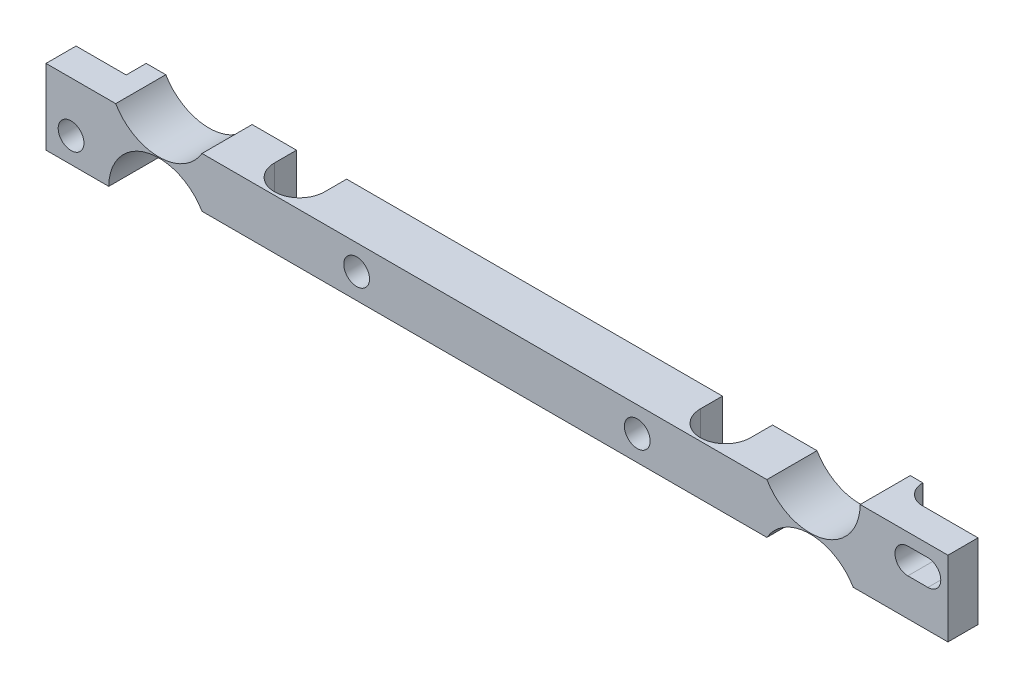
ISO-10303-21;
HEADER;
FILE_DESCRIPTION(('STEP AP214'),'2;1');
FILE_NAME('part.step','',(''),(''),'','','');
FILE_SCHEMA(('AUTOMOTIVE_DESIGN { 1 0 10303 214 1 1 1 1 }'));
ENDSEC;
DATA;
#1=APPLICATION_CONTEXT('core data for automotive mechanical design processes');
#2=APPLICATION_PROTOCOL_DEFINITION('international standard','automotive_design',2000,#1);
#3=PRODUCT_CONTEXT('',#1,'mechanical');
#4=PRODUCT('Part','Part','',(#3));
#5=PRODUCT_RELATED_PRODUCT_CATEGORY('part','',(#4));
#6=PRODUCT_DEFINITION_FORMATION('','',#4);
#7=PRODUCT_DEFINITION_CONTEXT('part definition',#1,'design');
#8=PRODUCT_DEFINITION('design','',#6,#7);
#9=PRODUCT_DEFINITION_SHAPE('','',#8);
#10=(LENGTH_UNIT() NAMED_UNIT(*) SI_UNIT(.MILLI.,.METRE.));
#11=(NAMED_UNIT(*) PLANE_ANGLE_UNIT() SI_UNIT($,.RADIAN.));
#12=(NAMED_UNIT(*) SI_UNIT($,.STERADIAN.) SOLID_ANGLE_UNIT());
#13=UNCERTAINTY_MEASURE_WITH_UNIT(LENGTH_MEASURE(1.E-05),#10,'distance_accuracy_value','');
#14=(GEOMETRIC_REPRESENTATION_CONTEXT(3) GLOBAL_UNCERTAINTY_ASSIGNED_CONTEXT((#13)) GLOBAL_UNIT_ASSIGNED_CONTEXT((#10,
#11,#12)) REPRESENTATION_CONTEXT('',''));
#15=CARTESIAN_POINT('',(0.,0.,0.));
#16=DIRECTION('',(0.,0.,1.));
#17=DIRECTION('',(1.,0.,0.));
#18=AXIS2_PLACEMENT_3D('',#15,#16,#17);
#19=CARTESIAN_POINT('',(-32.4430669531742,3.17499999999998,6.35));
#20=DIRECTION('',(0.,1.,0.));
#21=DIRECTION('',(-1.,0.,0.));
#22=AXIS2_PLACEMENT_3D('',#19,#20,#21);
#23=PLANE('',#22);
#24=DIRECTION('',(0.,0.,-1.));
#25=VECTOR('',#24,1.);
#26=CARTESIAN_POINT('',(79.375,3.175,6.35));
#27=LINE('',#26,#25);
#28=CARTESIAN_POINT('',(79.375,3.175,2.794));
#29=VERTEX_POINT('',#28);
#30=CARTESIAN_POINT('',(79.375,3.17499999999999,0.));
#31=VERTEX_POINT('',#30);
#32=EDGE_CURVE('E252',#29,#31,#27,.T.);
#33=ORIENTED_EDGE('',*,*,#32,.F.);
#34=CARTESIAN_POINT('',(82.55,3.175,2.794));
#35=DIRECTION('',(0.,1.,0.));
#36=DIRECTION('',(-1.,0.,0.));
#37=AXIS2_PLACEMENT_3D('',#34,#35,#36);
#38=CIRCLE('',#37,3.175);
#39=CARTESIAN_POINT('',(85.725,3.175,2.794));
#40=VERTEX_POINT('',#39);
#41=EDGE_CURVE('E229',#29,#40,#38,.T.);
#42=ORIENTED_EDGE('',*,*,#41,.T.);
#43=DIRECTION('',(0.,0.,-1.));
#44=VECTOR('',#43,1.);
#45=CARTESIAN_POINT('',(85.725,3.175,6.35));
#46=LINE('',#45,#44);
#47=CARTESIAN_POINT('',(85.725,3.17499999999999,0.));
#48=VERTEX_POINT('',#47);
#49=EDGE_CURVE('E248',#40,#48,#46,.T.);
#50=ORIENTED_EDGE('',*,*,#49,.T.);
#51=DIRECTION('',(1.,0.,0.));
#52=VECTOR('',#51,1.);
#53=CARTESIAN_POINT('',(-32.4430669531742,3.17499999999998,0.));
#54=LINE('',#53,#52);
#55=CARTESIAN_POINT('',(91.3551826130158,3.175,0.));
#56=VERTEX_POINT('',#55);
#57=EDGE_CURVE('E371',#48,#56,#54,.T.);
#58=ORIENTED_EDGE('',*,*,#57,.T.);
#59=DIRECTION('',(0.,0.,-1.));
#60=VECTOR('',#59,1.);
#61=CARTESIAN_POINT('',(91.3551826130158,3.175,6.35));
#62=LINE('',#61,#60);
#63=CARTESIAN_POINT('',(91.3551826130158,3.175,6.35));
#64=VERTEX_POINT('',#63);
#65=EDGE_CURVE('E432',#64,#56,#62,.T.);
#66=ORIENTED_EDGE('',*,*,#65,.F.);
#67=DIRECTION('',(1.,0.,0.));
#68=VECTOR('',#67,1.);
#69=CARTESIAN_POINT('',(-32.4430669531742,3.17499999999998,6.35));
#70=LINE('',#69,#68);
#71=CARTESIAN_POINT('',(19.7698173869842,3.17499999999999,6.35));
#72=VERTEX_POINT('',#71);
#73=EDGE_CURVE('E333',#72,#64,#70,.T.);
#74=ORIENTED_EDGE('',*,*,#73,.F.);
#75=DIRECTION('',(0.,0.,-1.));
#76=VECTOR('',#75,1.);
#77=CARTESIAN_POINT('',(19.7698173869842,3.17499999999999,6.35));
#78=LINE('',#77,#76);
#79=CARTESIAN_POINT('',(19.7698173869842,3.17499999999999,0.));
#80=VERTEX_POINT('',#79);
#81=EDGE_CURVE('E435',#72,#80,#78,.T.);
#82=ORIENTED_EDGE('',*,*,#81,.T.);
#83=CARTESIAN_POINT('',(25.4,3.17499999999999,0.));
#84=VERTEX_POINT('',#83);
#85=EDGE_CURVE('E372',#80,#84,#54,.T.);
#86=ORIENTED_EDGE('',*,*,#85,.T.);
#87=DIRECTION('',(0.,0.,-1.));
#88=VECTOR('',#87,1.);
#89=CARTESIAN_POINT('',(25.4,3.17499999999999,6.35));
#90=LINE('',#89,#88);
#91=CARTESIAN_POINT('',(25.4,3.17499999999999,2.794));
#92=VERTEX_POINT('',#91);
#93=EDGE_CURVE('E276',#92,#84,#90,.T.);
#94=ORIENTED_EDGE('',*,*,#93,.F.);
#95=CARTESIAN_POINT('',(28.575,3.17499999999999,2.794));
#96=DIRECTION('',(0.,1.,0.));
#97=DIRECTION('',(-1.,0.,0.));
#98=AXIS2_PLACEMENT_3D('',#95,#96,#97);
#99=CIRCLE('',#98,3.175);
#100=CARTESIAN_POINT('',(31.75,3.17499999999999,2.794));
#101=VERTEX_POINT('',#100);
#102=EDGE_CURVE('E264',#92,#101,#99,.T.);
#103=ORIENTED_EDGE('',*,*,#102,.T.);
#104=DIRECTION('',(0.,0.,-1.));
#105=VECTOR('',#104,1.);
#106=CARTESIAN_POINT('',(31.75,3.17499999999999,6.35));
#107=LINE('',#106,#105);
#108=CARTESIAN_POINT('',(31.75,3.17499999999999,0.));
#109=VERTEX_POINT('',#108);
#110=EDGE_CURVE('E273',#101,#109,#107,.T.);
#111=ORIENTED_EDGE('',*,*,#110,.T.);
#112=EDGE_CURVE('E376',#109,#31,#54,.T.);
#113=ORIENTED_EDGE('',*,*,#112,.T.);
#114=EDGE_LOOP('',(#33,#42,#50,#58,#66,#74,#82,#86,#94,#103,#111,#113));
#115=FACE_BOUND('',#114,.T.);
#116=ADVANCED_FACE('F30',(#115),#23,.F.);
#117=CARTESIAN_POINT('',(-32.4430669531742,9.52499999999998,6.35));
#118=DIRECTION('',(0.,1.,0.));
#119=DIRECTION('',(-1.,0.,0.));
#120=AXIS2_PLACEMENT_3D('',#117,#118,#119);
#121=PLANE('',#120);
#122=CARTESIAN_POINT('',(82.55,9.52499999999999,2.794));
#123=DIRECTION('',(0.,1.,0.));
#124=DIRECTION('',(0.,0.,1.));
#125=AXIS2_PLACEMENT_3D('',#122,#123,#124);
#126=CIRCLE('',#125,3.175);
#127=CARTESIAN_POINT('',(79.375,9.52499999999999,2.794));
#128=VERTEX_POINT('',#127);
#129=CARTESIAN_POINT('',(85.725,9.52499999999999,2.794));
#130=VERTEX_POINT('',#129);
#131=EDGE_CURVE('E227',#128,#130,#126,.T.);
#132=ORIENTED_EDGE('',*,*,#131,.F.);
#133=DIRECTION('',(0.,0.,-1.));
#134=VECTOR('',#133,1.);
#135=CARTESIAN_POINT('',(79.375,9.52499999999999,3.175));
#136=LINE('',#135,#134);
#137=CARTESIAN_POINT('',(79.375,9.52499999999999,0.));
#138=VERTEX_POINT('',#137);
#139=EDGE_CURVE('E235',#128,#138,#136,.T.);
#140=ORIENTED_EDGE('',*,*,#139,.T.);
#141=DIRECTION('',(1.,0.,0.));
#142=VECTOR('',#141,1.);
#143=CARTESIAN_POINT('',(-32.4430669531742,9.52499999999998,0.));
#144=LINE('',#143,#142);
#145=CARTESIAN_POINT('',(31.75,9.52499999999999,0.));
#146=VERTEX_POINT('',#145);
#147=EDGE_CURVE('E390',#146,#138,#144,.T.);
#148=ORIENTED_EDGE('',*,*,#147,.F.);
#149=DIRECTION('',(0.,0.,-1.));
#150=VECTOR('',#149,1.);
#151=CARTESIAN_POINT('',(31.75,9.52499999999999,3.175));
#152=LINE('',#151,#150);
#153=CARTESIAN_POINT('',(31.75,9.52499999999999,2.794));
#154=VERTEX_POINT('',#153);
#155=EDGE_CURVE('E259',#154,#146,#152,.T.);
#156=ORIENTED_EDGE('',*,*,#155,.F.);
#157=CARTESIAN_POINT('',(28.575,9.52499999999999,2.794));
#158=DIRECTION('',(0.,1.,0.));
#159=DIRECTION('',(0.,0.,1.));
#160=AXIS2_PLACEMENT_3D('',#157,#158,#159);
#161=CIRCLE('',#160,3.175);
#162=CARTESIAN_POINT('',(25.4,9.52499999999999,2.794));
#163=VERTEX_POINT('',#162);
#164=EDGE_CURVE('E256',#163,#154,#161,.T.);
#165=ORIENTED_EDGE('',*,*,#164,.F.);
#166=DIRECTION('',(0.,0.,-1.));
#167=VECTOR('',#166,1.);
#168=CARTESIAN_POINT('',(25.4,9.52499999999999,3.175));
#169=LINE('',#168,#167);
#170=CARTESIAN_POINT('',(25.4,9.52499999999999,0.));
#171=VERTEX_POINT('',#170);
#172=EDGE_CURVE('E53',#163,#171,#169,.T.);
#173=ORIENTED_EDGE('',*,*,#172,.T.);
#174=CARTESIAN_POINT('',(19.7698173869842,9.52499999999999,0.));
#175=VERTEX_POINT('',#174);
#176=EDGE_CURVE('E386',#175,#171,#144,.T.);
#177=ORIENTED_EDGE('',*,*,#176,.F.);
#178=DIRECTION('',(0.,0.,-1.));
#179=VECTOR('',#178,1.);
#180=CARTESIAN_POINT('',(19.7698173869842,9.52499999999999,6.35));
#181=LINE('',#180,#179);
#182=CARTESIAN_POINT('',(19.7698173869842,9.52499999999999,6.35));
#183=VERTEX_POINT('',#182);
#184=EDGE_CURVE('E416',#183,#175,#181,.T.);
#185=ORIENTED_EDGE('',*,*,#184,.F.);
#186=DIRECTION('',(1.,0.,0.));
#187=VECTOR('',#186,1.);
#188=CARTESIAN_POINT('',(-32.4430669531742,9.52499999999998,6.35));
#189=LINE('',#188,#187);
#190=CARTESIAN_POINT('',(91.3551826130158,9.525,6.35));
#191=VERTEX_POINT('',#190);
#192=EDGE_CURVE('E345',#183,#191,#189,.T.);
#193=ORIENTED_EDGE('',*,*,#192,.T.);
#194=DIRECTION('',(0.,0.,-1.));
#195=VECTOR('',#194,1.);
#196=CARTESIAN_POINT('',(91.3551826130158,9.525,6.35));
#197=LINE('',#196,#195);
#198=CARTESIAN_POINT('',(91.3551826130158,9.525,0.));
#199=VERTEX_POINT('',#198);
#200=EDGE_CURVE('E418',#191,#199,#197,.T.);
#201=ORIENTED_EDGE('',*,*,#200,.T.);
#202=CARTESIAN_POINT('',(85.725,9.525,0.));
#203=VERTEX_POINT('',#202);
#204=EDGE_CURVE('E385',#203,#199,#144,.T.);
#205=ORIENTED_EDGE('',*,*,#204,.F.);
#206=DIRECTION('',(0.,0.,-1.));
#207=VECTOR('',#206,1.);
#208=CARTESIAN_POINT('',(85.725,9.52499999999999,3.175));
#209=LINE('',#208,#207);
#210=EDGE_CURVE('E45',#130,#203,#209,.T.);
#211=ORIENTED_EDGE('',*,*,#210,.F.);
#212=EDGE_LOOP('',(#132,#140,#148,#156,#165,#173,#177,#185,#193,#201,#205,#211));
#213=FACE_BOUND('',#212,.T.);
#214=ADVANCED_FACE('F242',(#213),#121,.T.);
#215=CARTESIAN_POINT('',(-32.4430669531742,6.35000000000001,0.));
#216=DIRECTION('',(0.,0.,-1.));
#217=DIRECTION('',(-1.,0.,0.));
#218=AXIS2_PLACEMENT_3D('',#215,#216,#217);
#219=PLANE('',#218);
#220=CARTESIAN_POINT('',(39.37,6.35,0.));
#221=DIRECTION('',(0.,0.,-1.));
#222=DIRECTION('',(-1.,0.,0.));
#223=AXIS2_PLACEMENT_3D('',#220,#221,#222);
#224=CIRCLE('',#223,1.63195);
#225=CARTESIAN_POINT('',(37.73805,6.35,0.));
#226=VERTEX_POINT('',#225);
#227=EDGE_CURVE('E825',#226,#226,#224,.T.);
#228=ORIENTED_EDGE('',*,*,#227,.F.);
#229=EDGE_LOOP('',(#228));
#230=FACE_BOUND('',#229,.T.);
#231=CARTESIAN_POINT('',(74.93,6.35,0.));
#232=DIRECTION('',(0.,0.,-1.));
#233=DIRECTION('',(-1.,0.,0.));
#234=AXIS2_PLACEMENT_3D('',#231,#232,#233);
#235=CIRCLE('',#234,1.63194999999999);
#236=CARTESIAN_POINT('',(73.29805,6.35,0.));
#237=VERTEX_POINT('',#236);
#238=EDGE_CURVE('E828',#237,#237,#235,.T.);
#239=ORIENTED_EDGE('',*,*,#238,.F.);
#240=EDGE_LOOP('',(#239));
#241=FACE_BOUND('',#240,.T.);
#242=ORIENTED_EDGE('',*,*,#147,.T.);
#243=DIRECTION('',(0.,-1.,0.));
#244=VECTOR('',#243,1.);
#245=CARTESIAN_POINT('',(79.375,6.35000000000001,0.));
#246=LINE('',#245,#244);
#247=EDGE_CURVE('E11',#138,#31,#246,.T.);
#248=ORIENTED_EDGE('',*,*,#247,.T.);
#249=ORIENTED_EDGE('',*,*,#112,.F.);
#250=DIRECTION('',(0.,1.,0.));
#251=VECTOR('',#250,1.);
#252=CARTESIAN_POINT('',(31.75,0.,0.));
#253=LINE('',#252,#251);
#254=EDGE_CURVE('E265',#109,#146,#253,.T.);
#255=ORIENTED_EDGE('',*,*,#254,.T.);
#256=EDGE_LOOP('',(#242,#248,#249,#255));
#257=FACE_BOUND('',#256,.T.);
#258=ADVANCED_FACE('F508',(#230,#241,#257),#219,.T.);
#259=ORIENTED_EDGE('',*,*,#176,.T.);
#260=DIRECTION('',(0.,1.,0.));
#261=VECTOR('',#260,1.);
#262=CARTESIAN_POINT('',(25.4,0.,0.));
#263=LINE('',#262,#261);
#264=EDGE_CURVE('E262',#84,#171,#263,.T.);
#265=ORIENTED_EDGE('',*,*,#264,.F.);
#266=ORIENTED_EDGE('',*,*,#85,.F.);
#267=CARTESIAN_POINT('',(14.3002,-0.0508000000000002,0.));
#268=DIRECTION('',(0.,0.,-1.));
#269=DIRECTION('',(-1.,0.,0.));
#270=AXIS2_PLACEMENT_3D('',#267,#268,#269);
#271=CIRCLE('',#270,6.35);
#272=CARTESIAN_POINT('',(7.9504032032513,0.,0.));
#273=VERTEX_POINT('',#272);
#274=EDGE_CURVE('E369',#273,#80,#271,.T.);
#275=ORIENTED_EDGE('',*,*,#274,.F.);
#276=DIRECTION('',(-1.,0.,0.));
#277=VECTOR('',#276,1.);
#278=CARTESIAN_POINT('',(-32.4430669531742,0.,0.));
#279=LINE('',#278,#277);
#280=CARTESIAN_POINT('',(6.35,0.,0.));
#281=VERTEX_POINT('',#280);
#282=EDGE_CURVE('E326',#273,#281,#279,.T.);
#283=ORIENTED_EDGE('',*,*,#282,.T.);
#284=DIRECTION('',(0.,-1.,0.));
#285=VECTOR('',#284,1.);
#286=CARTESIAN_POINT('',(6.35,6.35000000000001,0.));
#287=LINE('',#286,#285);
#288=CARTESIAN_POINT('',(6.35,9.525,0.));
#289=VERTEX_POINT('',#288);
#290=EDGE_CURVE('E407',#289,#281,#287,.T.);
#291=ORIENTED_EDGE('',*,*,#290,.F.);
#292=DIRECTION('',(-1.,0.,0.));
#293=VECTOR('',#292,1.);
#294=CARTESIAN_POINT('',(-32.4430669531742,9.525,0.));
#295=LINE('',#294,#293);
#296=CARTESIAN_POINT('',(8.83058261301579,9.52499999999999,0.));
#297=VERTEX_POINT('',#296);
#298=EDGE_CURVE('E331',#297,#289,#295,.T.);
#299=ORIENTED_EDGE('',*,*,#298,.F.);
#300=CARTESIAN_POINT('',(14.3002,12.7508,0.));
#301=DIRECTION('',(0.,0.,-1.));
#302=DIRECTION('',(-1.,0.,0.));
#303=AXIS2_PLACEMENT_3D('',#300,#301,#302);
#304=CIRCLE('',#303,6.35);
#305=EDGE_CURVE('E389',#175,#297,#304,.T.);
#306=ORIENTED_EDGE('',*,*,#305,.F.);
#307=EDGE_LOOP('',(#259,#265,#266,#275,#283,#291,#299,#306));
#308=FACE_BOUND('',#307,.T.);
#309=ADVANCED_FACE('F496',(#308),#219,.T.);
#310=CARTESIAN_POINT('',(-32.4430669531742,7.89304999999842,6.35));
#311=DIRECTION('',(0.,-1.,0.));
#312=DIRECTION('',(1.,0.,0.));
#313=AXIS2_PLACEMENT_3D('',#310,#311,#312);
#314=PLANE('',#313);
#315=DIRECTION('',(1.,0.,0.));
#316=VECTOR('',#315,1.);
#317=CARTESIAN_POINT('',(-32.4430669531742,7.89304999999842,2.53999999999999));
#318=LINE('',#317,#316);
#319=CARTESIAN_POINT('',(109.22,7.89305,2.54));
#320=VERTEX_POINT('',#319);
#321=CARTESIAN_POINT('',(111.76,7.89305,2.54));
#322=VERTEX_POINT('',#321);
#323=EDGE_CURVE('E307',#320,#322,#318,.T.);
#324=ORIENTED_EDGE('',*,*,#323,.F.);
#325=DIRECTION('',(0.,0.,-1.));
#326=VECTOR('',#325,1.);
#327=CARTESIAN_POINT('',(109.22,7.89305,6.35));
#328=LINE('',#327,#326);
#329=CARTESIAN_POINT('',(109.22,7.89305,6.35));
#330=VERTEX_POINT('',#329);
#331=EDGE_CURVE('E404',#330,#320,#328,.T.);
#332=ORIENTED_EDGE('',*,*,#331,.F.);
#333=DIRECTION('',(-1.,0.,0.));
#334=VECTOR('',#333,1.);
#335=CARTESIAN_POINT('',(-32.4430669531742,7.89304999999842,6.35));
#336=LINE('',#335,#334);
#337=CARTESIAN_POINT('',(111.76,7.89305,6.35));
#338=VERTEX_POINT('',#337);
#339=EDGE_CURVE('E354',#338,#330,#336,.T.);
#340=ORIENTED_EDGE('',*,*,#339,.F.);
#341=DIRECTION('',(0.,0.,-1.));
#342=VECTOR('',#341,1.);
#343=CARTESIAN_POINT('',(111.76,7.89305,6.35));
#344=LINE('',#343,#342);
#345=EDGE_CURVE('E394',#338,#322,#344,.T.);
#346=ORIENTED_EDGE('',*,*,#345,.T.);
#347=EDGE_LOOP('',(#324,#332,#340,#346));
#348=FACE_BOUND('',#347,.T.);
#349=ADVANCED_FACE('F556',(#348),#314,.F.);
#350=CARTESIAN_POINT('',(109.22,9.525,6.35));
#351=DIRECTION('',(0.,0.,-1.));
#352=DIRECTION('',(-1.,0.,0.));
#353=AXIS2_PLACEMENT_3D('',#350,#351,#352);
#354=CYLINDRICAL_SURFACE('',#353,1.63195);
#355=CARTESIAN_POINT('',(109.22,9.525,2.54));
#356=DIRECTION('',(0.,0.,-1.));
#357=DIRECTION('',(-1.,0.,0.));
#358=AXIS2_PLACEMENT_3D('',#355,#356,#357);
#359=CIRCLE('',#358,1.63195);
#360=CARTESIAN_POINT('',(109.22,11.15695,2.54));
#361=VERTEX_POINT('',#360);
#362=EDGE_CURVE('E305',#361,#320,#359,.F.);
#363=ORIENTED_EDGE('',*,*,#362,.F.);
#364=DIRECTION('',(0.,0.,-1.));
#365=VECTOR('',#364,1.);
#366=CARTESIAN_POINT('',(109.22,11.15695,6.35));
#367=LINE('',#366,#365);
#368=CARTESIAN_POINT('',(109.22,11.15695,6.35));
#369=VERTEX_POINT('',#368);
#370=EDGE_CURVE('E401',#369,#361,#367,.T.);
#371=ORIENTED_EDGE('',*,*,#370,.F.);
#372=CARTESIAN_POINT('',(109.22,9.525,6.35));
#373=DIRECTION('',(0.,0.,-1.));
#374=DIRECTION('',(-1.,0.,0.));
#375=AXIS2_PLACEMENT_3D('',#372,#373,#374);
#376=CIRCLE('',#375,1.63195);
#377=EDGE_CURVE('E357',#330,#369,#376,.T.);
#378=ORIENTED_EDGE('',*,*,#377,.F.);
#379=ORIENTED_EDGE('',*,*,#331,.T.);
#380=EDGE_LOOP('',(#363,#371,#378,#379));
#381=FACE_BOUND('',#380,.T.);
#382=ADVANCED_FACE('F550',(#381),#354,.F.);
#383=CARTESIAN_POINT('',(-32.4430669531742,11.15695,6.35));
#384=DIRECTION('',(0.,1.,0.));
#385=DIRECTION('',(0.,0.,1.));
#386=AXIS2_PLACEMENT_3D('',#383,#384,#385);
#387=PLANE('',#386);
#388=DIRECTION('',(-1.,0.,0.));
#389=VECTOR('',#388,1.);
#390=CARTESIAN_POINT('',(-32.4430669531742,11.15695,2.53999999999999));
#391=LINE('',#390,#389);
#392=CARTESIAN_POINT('',(111.76,11.15695,2.54));
#393=VERTEX_POINT('',#392);
#394=EDGE_CURVE('E297',#393,#361,#391,.T.);
#395=ORIENTED_EDGE('',*,*,#394,.F.);
#396=DIRECTION('',(0.,0.,-1.));
#397=VECTOR('',#396,1.);
#398=CARTESIAN_POINT('',(111.76,11.15695,6.35));
#399=LINE('',#398,#397);
#400=CARTESIAN_POINT('',(111.76,11.15695,6.35));
#401=VERTEX_POINT('',#400);
#402=EDGE_CURVE('E397',#401,#393,#399,.T.);
#403=ORIENTED_EDGE('',*,*,#402,.F.);
#404=DIRECTION('',(1.,0.,0.));
#405=VECTOR('',#404,1.);
#406=CARTESIAN_POINT('',(-32.4430669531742,11.15695,6.35));
#407=LINE('',#406,#405);
#408=EDGE_CURVE('E359',#369,#401,#407,.T.);
#409=ORIENTED_EDGE('',*,*,#408,.F.);
#410=ORIENTED_EDGE('',*,*,#370,.T.);
#411=EDGE_LOOP('',(#395,#403,#409,#410));
#412=FACE_BOUND('',#411,.T.);
#413=ADVANCED_FACE('F545',(#412),#387,.F.);
#414=DIRECTION('',(1.,0.,0.));
#415=VECTOR('',#414,1.);
#416=CARTESIAN_POINT('',(97.5918775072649,3.17499999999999,2.54));
#417=LINE('',#416,#415);
#418=CARTESIAN_POINT('',(107.2896,3.17499999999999,2.54));
#419=VERTEX_POINT('',#418);
#420=CARTESIAN_POINT('',(114.3,3.17499999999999,2.54));
#421=VERTEX_POINT('',#420);
#422=EDGE_CURVE('E278',#419,#421,#417,.T.);
#423=ORIENTED_EDGE('',*,*,#422,.T.);
#424=DIRECTION('',(0.,0.,-1.));
#425=VECTOR('',#424,1.);
#426=CARTESIAN_POINT('',(114.3,3.175,6.35));
#427=LINE('',#426,#425);
#428=CARTESIAN_POINT('',(114.3,3.175,6.35));
#429=VERTEX_POINT('',#428);
#430=EDGE_CURVE('E426',#429,#421,#427,.T.);
#431=ORIENTED_EDGE('',*,*,#430,.F.);
#432=CARTESIAN_POINT('',(102.294417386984,3.175,6.35));
#433=VERTEX_POINT('',#432);
#434=EDGE_CURVE('E336',#433,#429,#70,.T.);
#435=ORIENTED_EDGE('',*,*,#434,.F.);
#436=DIRECTION('',(0.,0.,-1.));
#437=VECTOR('',#436,1.);
#438=CARTESIAN_POINT('',(102.294417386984,3.175,6.35));
#439=LINE('',#438,#437);
#440=CARTESIAN_POINT('',(102.294417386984,3.175,0.));
#441=VERTEX_POINT('',#440);
#442=EDGE_CURVE('E429',#433,#441,#439,.T.);
#443=ORIENTED_EDGE('',*,*,#442,.T.);
#444=CARTESIAN_POINT('',(104.775,3.175,0.));
#445=VERTEX_POINT('',#444);
#446=EDGE_CURVE('E377',#441,#445,#54,.T.);
#447=ORIENTED_EDGE('',*,*,#446,.T.);
#448=DIRECTION('',(0.,0.,1.));
#449=VECTOR('',#448,1.);
#450=CARTESIAN_POINT('',(104.775,3.17499999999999,3.175));
#451=LINE('',#450,#449);
#452=CARTESIAN_POINT('',(104.775,3.17499999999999,0.0253999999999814));
#453=VERTEX_POINT('',#452);
#454=EDGE_CURVE('E282',#445,#453,#451,.T.);
#455=ORIENTED_EDGE('',*,*,#454,.T.);
#456=CARTESIAN_POINT('',(107.2896,3.17499999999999,0.0253999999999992));
#457=DIRECTION('',(0.,1.,0.));
#458=DIRECTION('',(0.,0.,1.));
#459=AXIS2_PLACEMENT_3D('',#456,#457,#458);
#460=CIRCLE('',#459,2.5146);
#461=EDGE_CURVE('E290',#419,#453,#460,.F.);
#462=ORIENTED_EDGE('',*,*,#461,.F.);
#463=EDGE_LOOP('',(#423,#431,#435,#443,#447,#455,#462));
#464=FACE_BOUND('',#463,.T.);
#465=ADVANCED_FACE('F455',(#464),#23,.F.);
#466=CARTESIAN_POINT('',(114.3,6.35000000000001,6.35));
#467=DIRECTION('',(-1.,0.,0.));
#468=DIRECTION('',(0.,0.,1.));
#469=AXIS2_PLACEMENT_3D('',#466,#467,#468);
#470=PLANE('',#469);
#471=DIRECTION('',(0.,-1.,0.));
#472=VECTOR('',#471,1.);
#473=CARTESIAN_POINT('',(114.3,12.7,2.54));
#474=LINE('',#473,#472);
#475=CARTESIAN_POINT('',(114.3,12.7,2.54));
#476=VERTEX_POINT('',#475);
#477=EDGE_CURVE('E295',#476,#421,#474,.T.);
#478=ORIENTED_EDGE('',*,*,#477,.F.);
#479=DIRECTION('',(0.,0.,-1.));
#480=VECTOR('',#479,1.);
#481=CARTESIAN_POINT('',(114.3,12.7,6.35));
#482=LINE('',#481,#480);
#483=CARTESIAN_POINT('',(114.3,12.7,6.35));
#484=VERTEX_POINT('',#483);
#485=EDGE_CURVE('E423',#484,#476,#482,.T.);
#486=ORIENTED_EDGE('',*,*,#485,.F.);
#487=DIRECTION('',(0.,1.,0.));
#488=VECTOR('',#487,1.);
#489=CARTESIAN_POINT('',(114.3,6.35000000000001,6.35));
#490=LINE('',#489,#488);
#491=EDGE_CURVE('E338',#429,#484,#490,.T.);
#492=ORIENTED_EDGE('',*,*,#491,.F.);
#493=ORIENTED_EDGE('',*,*,#430,.T.);
#494=EDGE_LOOP('',(#478,#486,#492,#493));
#495=FACE_BOUND('',#494,.T.);
#496=ADVANCED_FACE('F477',(#495),#470,.F.);
#497=CARTESIAN_POINT('',(-32.4430669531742,12.7,6.35));
#498=DIRECTION('',(0.,1.,0.));
#499=DIRECTION('',(0.,0.,1.));
#500=AXIS2_PLACEMENT_3D('',#497,#498,#499);
#501=PLANE('',#500);
#502=ORIENTED_EDGE('',*,*,#485,.T.);
#503=DIRECTION('',(1.,0.,0.));
#504=VECTOR('',#503,1.);
#505=CARTESIAN_POINT('',(97.5918775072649,12.7,2.54));
#506=LINE('',#505,#504);
#507=CARTESIAN_POINT('',(107.2896,12.7,2.54));
#508=VERTEX_POINT('',#507);
#509=EDGE_CURVE('E279',#508,#476,#506,.T.);
#510=ORIENTED_EDGE('',*,*,#509,.F.);
#511=CARTESIAN_POINT('',(107.2896,12.7,0.0253999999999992));
#512=DIRECTION('',(0.,1.,0.));
#513=DIRECTION('',(0.,0.,1.));
#514=AXIS2_PLACEMENT_3D('',#511,#512,#513);
#515=CIRCLE('',#514,2.5146);
#516=CARTESIAN_POINT('',(104.775,12.7,0.0253999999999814));
#517=VERTEX_POINT('',#516);
#518=EDGE_CURVE('E281',#508,#517,#515,.F.);
#519=ORIENTED_EDGE('',*,*,#518,.T.);
#520=DIRECTION('',(0.,0.,1.));
#521=VECTOR('',#520,1.);
#522=CARTESIAN_POINT('',(104.775,12.7,3.175));
#523=LINE('',#522,#521);
#524=CARTESIAN_POINT('',(104.775,12.7,0.));
#525=VERTEX_POINT('',#524);
#526=EDGE_CURVE('E285',#525,#517,#523,.T.);
#527=ORIENTED_EDGE('',*,*,#526,.F.);
#528=DIRECTION('',(1.,0.,0.));
#529=VECTOR('',#528,1.);
#530=CARTESIAN_POINT('',(-32.4430669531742,12.7,0.));
#531=LINE('',#530,#529);
#532=CARTESIAN_POINT('',(103.174596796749,12.7,0.));
#533=VERTEX_POINT('',#532);
#534=EDGE_CURVE('E379',#533,#525,#531,.T.);
#535=ORIENTED_EDGE('',*,*,#534,.F.);
#536=DIRECTION('',(0.,0.,-1.));
#537=VECTOR('',#536,1.);
#538=CARTESIAN_POINT('',(103.174596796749,12.7,6.35));
#539=LINE('',#538,#537);
#540=CARTESIAN_POINT('',(103.174596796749,12.7,6.35));
#541=VERTEX_POINT('',#540);
#542=EDGE_CURVE('E421',#541,#533,#539,.T.);
#543=ORIENTED_EDGE('',*,*,#542,.F.);
#544=DIRECTION('',(1.,0.,0.));
#545=VECTOR('',#544,1.);
#546=CARTESIAN_POINT('',(-32.4430669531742,12.7,6.35));
#547=LINE('',#546,#545);
#548=EDGE_CURVE('E340',#541,#484,#547,.T.);
#549=ORIENTED_EDGE('',*,*,#548,.T.);
#550=EDGE_LOOP('',(#502,#510,#519,#527,#535,#543,#549));
#551=FACE_BOUND('',#550,.T.);
#552=ADVANCED_FACE('F466',(#551),#501,.T.);
#553=CARTESIAN_POINT('',(111.76,9.525,6.35));
#554=DIRECTION('',(0.,0.,-1.));
#555=DIRECTION('',(-1.,0.,0.));
#556=AXIS2_PLACEMENT_3D('',#553,#554,#555);
#557=CYLINDRICAL_SURFACE('',#556,1.63195);
#558=CARTESIAN_POINT('',(111.76,9.525,2.54));
#559=DIRECTION('',(0.,0.,-1.));
#560=DIRECTION('',(-1.,0.,0.));
#561=AXIS2_PLACEMENT_3D('',#558,#559,#560);
#562=CIRCLE('',#561,1.63195);
#563=EDGE_CURVE('E440',#322,#393,#562,.F.);
#564=ORIENTED_EDGE('',*,*,#563,.F.);
#565=ORIENTED_EDGE('',*,*,#345,.F.);
#566=CARTESIAN_POINT('',(111.76,9.525,6.35));
#567=DIRECTION('',(0.,0.,-1.));
#568=DIRECTION('',(-1.,0.,0.));
#569=AXIS2_PLACEMENT_3D('',#566,#567,#568);
#570=CIRCLE('',#569,1.63195);
#571=EDGE_CURVE('E361',#401,#338,#570,.T.);
#572=ORIENTED_EDGE('',*,*,#571,.F.);
#573=ORIENTED_EDGE('',*,*,#402,.T.);
#574=EDGE_LOOP('',(#564,#565,#572,#573));
#575=FACE_BOUND('',#574,.T.);
#576=ADVANCED_FACE('F561',(#575),#557,.F.);
#577=DIRECTION('',(0.,-1.,0.));
#578=VECTOR('',#577,1.);
#579=CARTESIAN_POINT('',(85.725,6.35000000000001,0.));
#580=LINE('',#579,#578);
#581=EDGE_CURVE('E38',#203,#48,#580,.T.);
#582=ORIENTED_EDGE('',*,*,#581,.F.);
#583=ORIENTED_EDGE('',*,*,#204,.T.);
#584=CARTESIAN_POINT('',(96.8248,12.7508,0.));
#585=DIRECTION('',(0.,0.,-1.));
#586=DIRECTION('',(-1.,0.,0.));
#587=AXIS2_PLACEMENT_3D('',#584,#585,#586);
#588=CIRCLE('',#587,6.35);
#589=EDGE_CURVE('E382',#533,#199,#588,.T.);
#590=ORIENTED_EDGE('',*,*,#589,.F.);
#591=ORIENTED_EDGE('',*,*,#534,.T.);
#592=DIRECTION('',(0.,-1.,0.));
#593=VECTOR('',#592,1.);
#594=CARTESIAN_POINT('',(104.775,12.7,0.));
#595=LINE('',#594,#593);
#596=EDGE_CURVE('E298',#525,#445,#595,.T.);
#597=ORIENTED_EDGE('',*,*,#596,.T.);
#598=ORIENTED_EDGE('',*,*,#446,.F.);
#599=CARTESIAN_POINT('',(96.8248,-0.0508000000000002,0.));
#600=DIRECTION('',(0.,0.,-1.));
#601=DIRECTION('',(-1.,0.,0.));
#602=AXIS2_PLACEMENT_3D('',#599,#600,#601);
#603=CIRCLE('',#602,6.35);
#604=EDGE_CURVE('E375',#56,#441,#603,.T.);
#605=ORIENTED_EDGE('',*,*,#604,.F.);
#606=ORIENTED_EDGE('',*,*,#57,.F.);
#607=EDGE_LOOP('',(#582,#583,#590,#591,#597,#598,#605,#606));
#608=FACE_BOUND('',#607,.T.);
#609=ADVANCED_FACE('F449',(#608),#219,.T.);
#610=CARTESIAN_POINT('',(-32.4430669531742,0.,6.35));
#611=DIRECTION('',(0.,-1.,0.));
#612=DIRECTION('',(0.,0.,-1.));
#613=AXIS2_PLACEMENT_3D('',#610,#611,#612);
#614=PLANE('',#613);
#615=DIRECTION('',(-1.,0.,0.));
#616=VECTOR('',#615,1.);
#617=CARTESIAN_POINT('',(0.,0.,2.54));
#618=LINE('',#617,#616);
#619=CARTESIAN_POINT('',(6.35,0.,2.54));
#620=VERTEX_POINT('',#619);
#621=CARTESIAN_POINT('',(0.,0.,2.54));
#622=VERTEX_POINT('',#621);
#623=EDGE_CURVE('E312',#620,#622,#618,.T.);
#624=ORIENTED_EDGE('',*,*,#623,.F.);
#625=DIRECTION('',(0.,0.,1.));
#626=VECTOR('',#625,1.);
#627=CARTESIAN_POINT('',(6.35,0.,0.));
#628=LINE('',#627,#626);
#629=EDGE_CURVE('E309',#281,#620,#628,.T.);
#630=ORIENTED_EDGE('',*,*,#629,.F.);
#631=ORIENTED_EDGE('',*,*,#282,.F.);
#632=DIRECTION('',(0.,0.,-1.));
#633=VECTOR('',#632,1.);
#634=CARTESIAN_POINT('',(7.9504032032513,0.,6.35));
#635=LINE('',#634,#633);
#636=CARTESIAN_POINT('',(7.9504032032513,0.,6.35));
#637=VERTEX_POINT('',#636);
#638=EDGE_CURVE('E398',#637,#273,#635,.T.);
#639=ORIENTED_EDGE('',*,*,#638,.F.);
#640=DIRECTION('',(-1.,0.,0.));
#641=VECTOR('',#640,1.);
#642=CARTESIAN_POINT('',(-32.4430669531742,0.,6.35));
#643=LINE('',#642,#641);
#644=CARTESIAN_POINT('',(0.,0.,6.35));
#645=VERTEX_POINT('',#644);
#646=EDGE_CURVE('E327',#637,#645,#643,.T.);
#647=ORIENTED_EDGE('',*,*,#646,.T.);
#648=DIRECTION('',(0.,0.,-1.));
#649=VECTOR('',#648,1.);
#650=CARTESIAN_POINT('',(0.,0.,6.35));
#651=LINE('',#650,#649);
#652=EDGE_CURVE('E366',#645,#622,#651,.T.);
#653=ORIENTED_EDGE('',*,*,#652,.T.);
#654=EDGE_LOOP('',(#624,#630,#631,#639,#647,#653));
#655=FACE_BOUND('',#654,.T.);
#656=ADVANCED_FACE('F32',(#655),#614,.T.);
#657=CARTESIAN_POINT('',(14.3002,-0.0508000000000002,6.35));
#658=DIRECTION('',(0.,0.,-1.));
#659=DIRECTION('',(-1.,0.,0.));
#660=AXIS2_PLACEMENT_3D('',#657,#658,#659);
#661=CYLINDRICAL_SURFACE('',#660,6.35);
#662=ORIENTED_EDGE('',*,*,#274,.T.);
#663=ORIENTED_EDGE('',*,*,#81,.F.);
#664=CARTESIAN_POINT('',(14.3002,-0.0508000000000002,6.35));
#665=DIRECTION('',(0.,0.,-1.));
#666=DIRECTION('',(-1.,0.,0.));
#667=AXIS2_PLACEMENT_3D('',#664,#665,#666);
#668=CIRCLE('',#667,6.35);
#669=EDGE_CURVE('E330',#637,#72,#668,.T.);
#670=ORIENTED_EDGE('',*,*,#669,.F.);
#671=ORIENTED_EDGE('',*,*,#638,.T.);
#672=EDGE_LOOP('',(#662,#663,#670,#671));
#673=FACE_BOUND('',#672,.T.);
#674=ADVANCED_FACE('F530',(#673),#661,.F.);
#675=CARTESIAN_POINT('',(96.8248,-0.0508000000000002,6.35));
#676=DIRECTION('',(0.,0.,-1.));
#677=DIRECTION('',(-1.,0.,0.));
#678=AXIS2_PLACEMENT_3D('',#675,#676,#677);
#679=CYLINDRICAL_SURFACE('',#678,6.35);
#680=ORIENTED_EDGE('',*,*,#604,.T.);
#681=ORIENTED_EDGE('',*,*,#442,.F.);
#682=CARTESIAN_POINT('',(96.8248,-0.0508000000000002,6.35));
#683=DIRECTION('',(0.,0.,-1.));
#684=DIRECTION('',(-1.,0.,0.));
#685=AXIS2_PLACEMENT_3D('',#682,#683,#684);
#686=CIRCLE('',#685,6.35);
#687=EDGE_CURVE('E335',#64,#433,#686,.T.);
#688=ORIENTED_EDGE('',*,*,#687,.F.);
#689=ORIENTED_EDGE('',*,*,#65,.T.);
#690=EDGE_LOOP('',(#680,#681,#688,#689));
#691=FACE_BOUND('',#690,.T.);
#692=ADVANCED_FACE('F487',(#691),#679,.F.);
#693=CARTESIAN_POINT('',(96.8248,12.7508,6.35));
#694=DIRECTION('',(0.,0.,-1.));
#695=DIRECTION('',(-1.,0.,0.));
#696=AXIS2_PLACEMENT_3D('',#693,#694,#695);
#697=CYLINDRICAL_SURFACE('',#696,6.35);
#698=ORIENTED_EDGE('',*,*,#589,.T.);
#699=ORIENTED_EDGE('',*,*,#200,.F.);
#700=CARTESIAN_POINT('',(96.8248,12.7508,6.35));
#701=DIRECTION('',(0.,0.,-1.));
#702=DIRECTION('',(-1.,0.,0.));
#703=AXIS2_PLACEMENT_3D('',#700,#701,#702);
#704=CIRCLE('',#703,6.35);
#705=EDGE_CURVE('E343',#541,#191,#704,.T.);
#706=ORIENTED_EDGE('',*,*,#705,.F.);
#707=ORIENTED_EDGE('',*,*,#542,.T.);
#708=EDGE_LOOP('',(#698,#699,#706,#707));
#709=FACE_BOUND('',#708,.T.);
#710=ADVANCED_FACE('F513',(#709),#697,.F.);
#711=CARTESIAN_POINT('',(14.3002,12.7508,6.35));
#712=DIRECTION('',(0.,0.,-1.));
#713=DIRECTION('',(-1.,0.,0.));
#714=AXIS2_PLACEMENT_3D('',#711,#712,#713);
#715=CYLINDRICAL_SURFACE('',#714,6.35);
#716=ORIENTED_EDGE('',*,*,#305,.T.);
#717=DIRECTION('',(0.,0.,-1.));
#718=VECTOR('',#717,1.);
#719=CARTESIAN_POINT('',(8.83058261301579,9.52499999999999,6.35));
#720=LINE('',#719,#718);
#721=CARTESIAN_POINT('',(8.83058261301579,9.52499999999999,6.35));
#722=VERTEX_POINT('',#721);
#723=EDGE_CURVE('E413',#722,#297,#720,.T.);
#724=ORIENTED_EDGE('',*,*,#723,.F.);
#725=CARTESIAN_POINT('',(14.3002,12.7508,6.35));
#726=DIRECTION('',(0.,0.,-1.));
#727=DIRECTION('',(-1.,0.,0.));
#728=AXIS2_PLACEMENT_3D('',#725,#726,#727);
#729=CIRCLE('',#728,6.35);
#730=EDGE_CURVE('E348',#183,#722,#729,.T.);
#731=ORIENTED_EDGE('',*,*,#730,.F.);
#732=ORIENTED_EDGE('',*,*,#184,.T.);
#733=EDGE_LOOP('',(#716,#724,#731,#732));
#734=FACE_BOUND('',#733,.T.);
#735=ADVANCED_FACE('F519',(#734),#715,.F.);
#736=CARTESIAN_POINT('',(-32.4430669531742,9.525,6.35));
#737=DIRECTION('',(0.,-1.,0.));
#738=DIRECTION('',(0.,0.,-1.));
#739=AXIS2_PLACEMENT_3D('',#736,#737,#738);
#740=PLANE('',#739);
#741=DIRECTION('',(0.,0.,1.));
#742=VECTOR('',#741,1.);
#743=CARTESIAN_POINT('',(6.35,9.525,6.35));
#744=LINE('',#743,#742);
#745=CARTESIAN_POINT('',(6.35,9.525,2.54));
#746=VERTEX_POINT('',#745);
#747=EDGE_CURVE('E318',#289,#746,#744,.T.);
#748=ORIENTED_EDGE('',*,*,#747,.T.);
#749=DIRECTION('',(-1.,0.,0.));
#750=VECTOR('',#749,1.);
#751=CARTESIAN_POINT('',(-32.4430669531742,9.525,2.54));
#752=LINE('',#751,#750);
#753=CARTESIAN_POINT('',(0.,9.525,2.54));
#754=VERTEX_POINT('',#753);
#755=EDGE_CURVE('E323',#746,#754,#752,.T.);
#756=ORIENTED_EDGE('',*,*,#755,.T.);
#757=DIRECTION('',(0.,0.,-1.));
#758=VECTOR('',#757,1.);
#759=CARTESIAN_POINT('',(0.,9.525,6.35));
#760=LINE('',#759,#758);
#761=CARTESIAN_POINT('',(0.,9.525,6.35));
#762=VERTEX_POINT('',#761);
#763=EDGE_CURVE('E410',#762,#754,#760,.T.);
#764=ORIENTED_EDGE('',*,*,#763,.F.);
#765=DIRECTION('',(-1.,0.,0.));
#766=VECTOR('',#765,1.);
#767=CARTESIAN_POINT('',(-32.4430669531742,9.525,6.35));
#768=LINE('',#767,#766);
#769=EDGE_CURVE('E350',#722,#762,#768,.T.);
#770=ORIENTED_EDGE('',*,*,#769,.F.);
#771=ORIENTED_EDGE('',*,*,#723,.T.);
#772=ORIENTED_EDGE('',*,*,#298,.T.);
#773=EDGE_LOOP('',(#748,#756,#764,#770,#771,#772));
#774=FACE_BOUND('',#773,.T.);
#775=ADVANCED_FACE('F522',(#774),#740,.F.);
#776=CARTESIAN_POINT('',(0.,6.35000000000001,6.35));
#777=DIRECTION('',(1.,0.,0.));
#778=DIRECTION('',(0.,0.,-1.));
#779=AXIS2_PLACEMENT_3D('',#776,#777,#778);
#780=PLANE('',#779);
#781=ORIENTED_EDGE('',*,*,#763,.T.);
#782=DIRECTION('',(0.,-1.,0.));
#783=VECTOR('',#782,1.);
#784=CARTESIAN_POINT('',(0.,12.7,2.54));
#785=LINE('',#784,#783);
#786=EDGE_CURVE('E315',#754,#622,#785,.T.);
#787=ORIENTED_EDGE('',*,*,#786,.T.);
#788=ORIENTED_EDGE('',*,*,#652,.F.);
#789=DIRECTION('',(0.,-1.,0.));
#790=VECTOR('',#789,1.);
#791=CARTESIAN_POINT('',(0.,6.35000000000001,6.35));
#792=LINE('',#791,#790);
#793=EDGE_CURVE('E352',#762,#645,#792,.T.);
#794=ORIENTED_EDGE('',*,*,#793,.F.);
#795=EDGE_LOOP('',(#781,#787,#788,#794));
#796=FACE_BOUND('',#795,.T.);
#797=ADVANCED_FACE('F526',(#796),#780,.F.);
#798=CARTESIAN_POINT('',(3.175,3.175,6.35));
#799=DIRECTION('',(0.,0.,-1.));
#800=DIRECTION('',(-1.,0.,0.));
#801=AXIS2_PLACEMENT_3D('',#798,#799,#800);
#802=CYLINDRICAL_SURFACE('',#801,1.63195);
#803=CARTESIAN_POINT('',(3.175,3.175,2.54));
#804=DIRECTION('',(0.,0.,1.));
#805=DIRECTION('',(1.,0.,0.));
#806=AXIS2_PLACEMENT_3D('',#803,#804,#805);
#807=CIRCLE('',#806,1.63195);
#808=CARTESIAN_POINT('',(4.80695,3.175,2.54));
#809=VERTEX_POINT('',#808);
#810=EDGE_CURVE('E322',#809,#809,#807,.F.);
#811=ORIENTED_EDGE('',*,*,#810,.T.);
#812=EDGE_LOOP('',(#811));
#813=FACE_BOUND('',#812,.T.);
#814=CARTESIAN_POINT('',(3.175,3.175,6.35));
#815=DIRECTION('',(0.,0.,-1.));
#816=DIRECTION('',(-1.,0.,0.));
#817=AXIS2_PLACEMENT_3D('',#814,#815,#816);
#818=CIRCLE('',#817,1.63195);
#819=CARTESIAN_POINT('',(1.54305,3.175,6.35));
#820=VERTEX_POINT('',#819);
#821=EDGE_CURVE('E363',#820,#820,#818,.T.);
#822=ORIENTED_EDGE('',*,*,#821,.F.);
#823=EDGE_LOOP('',(#822));
#824=FACE_BOUND('',#823,.T.);
#825=ADVANCED_FACE('F569',(#813,#824),#802,.F.);
#826=CARTESIAN_POINT('',(-32.4430669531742,6.35000000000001,6.35));
#827=DIRECTION('',(0.,0.,-1.));
#828=DIRECTION('',(-1.,0.,0.));
#829=AXIS2_PLACEMENT_3D('',#826,#827,#828);
#830=PLANE('',#829);
#831=CARTESIAN_POINT('',(39.37,6.35,6.35));
#832=DIRECTION('',(0.,0.,-1.));
#833=DIRECTION('',(-1.,0.,0.));
#834=AXIS2_PLACEMENT_3D('',#831,#832,#833);
#835=CIRCLE('',#834,1.63195);
#836=CARTESIAN_POINT('',(37.73805,6.35,6.35));
#837=VERTEX_POINT('',#836);
#838=EDGE_CURVE('E830',#837,#837,#835,.T.);
#839=ORIENTED_EDGE('',*,*,#838,.T.);
#840=EDGE_LOOP('',(#839));
#841=FACE_BOUND('',#840,.T.);
#842=CARTESIAN_POINT('',(74.93,6.35,6.35));
#843=DIRECTION('',(0.,0.,-1.));
#844=DIRECTION('',(-1.,0.,0.));
#845=AXIS2_PLACEMENT_3D('',#842,#843,#844);
#846=CIRCLE('',#845,1.63194999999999);
#847=CARTESIAN_POINT('',(73.29805,6.35,6.35));
#848=VERTEX_POINT('',#847);
#849=EDGE_CURVE('E240',#848,#848,#846,.T.);
#850=ORIENTED_EDGE('',*,*,#849,.T.);
#851=EDGE_LOOP('',(#850));
#852=FACE_BOUND('',#851,.T.);
#853=ORIENTED_EDGE('',*,*,#646,.F.);
#854=ORIENTED_EDGE('',*,*,#669,.T.);
#855=ORIENTED_EDGE('',*,*,#73,.T.);
#856=ORIENTED_EDGE('',*,*,#687,.T.);
#857=ORIENTED_EDGE('',*,*,#434,.T.);
#858=ORIENTED_EDGE('',*,*,#491,.T.);
#859=ORIENTED_EDGE('',*,*,#548,.F.);
#860=ORIENTED_EDGE('',*,*,#705,.T.);
#861=ORIENTED_EDGE('',*,*,#192,.F.);
#862=ORIENTED_EDGE('',*,*,#730,.T.);
#863=ORIENTED_EDGE('',*,*,#769,.T.);
#864=ORIENTED_EDGE('',*,*,#793,.T.);
#865=EDGE_LOOP('',(#853,#854,#855,#856,#857,#858,#859,#860,#861,#862,#863,#864));
#866=FACE_BOUND('',#865,.T.);
#867=ORIENTED_EDGE('',*,*,#339,.T.);
#868=ORIENTED_EDGE('',*,*,#377,.T.);
#869=ORIENTED_EDGE('',*,*,#408,.T.);
#870=ORIENTED_EDGE('',*,*,#571,.T.);
#871=EDGE_LOOP('',(#867,#868,#869,#870));
#872=FACE_BOUND('',#871,.T.);
#873=ORIENTED_EDGE('',*,*,#821,.T.);
#874=EDGE_LOOP('',(#873));
#875=FACE_BOUND('',#874,.T.);
#876=ADVANCED_FACE('F482',(#841,#852,#866,#872,#875),#830,.F.);
#877=CARTESIAN_POINT('',(0.,12.7,2.54));
#878=DIRECTION('',(0.,0.,1.));
#879=DIRECTION('',(1.,0.,0.));
#880=AXIS2_PLACEMENT_3D('',#877,#878,#879);
#881=PLANE('',#880);
#882=ORIENTED_EDGE('',*,*,#810,.F.);
#883=EDGE_LOOP('',(#882));
#884=FACE_BOUND('',#883,.T.);
#885=DIRECTION('',(0.,-1.,0.));
#886=VECTOR('',#885,1.);
#887=CARTESIAN_POINT('',(6.35,12.7,2.54));
#888=LINE('',#887,#886);
#889=EDGE_CURVE('E314',#746,#620,#888,.T.);
#890=ORIENTED_EDGE('',*,*,#889,.T.);
#891=ORIENTED_EDGE('',*,*,#623,.T.);
#892=ORIENTED_EDGE('',*,*,#786,.F.);
#893=ORIENTED_EDGE('',*,*,#755,.F.);
#894=EDGE_LOOP('',(#890,#891,#892,#893));
#895=FACE_BOUND('',#894,.T.);
#896=ADVANCED_FACE('F606',(#884,#895),#881,.F.);
#897=CARTESIAN_POINT('',(6.35,12.7,0.));
#898=DIRECTION('',(1.,0.,0.));
#899=DIRECTION('',(0.,0.,-1.));
#900=AXIS2_PLACEMENT_3D('',#897,#898,#899);
#901=PLANE('',#900);
#902=ORIENTED_EDGE('',*,*,#290,.T.);
#903=ORIENTED_EDGE('',*,*,#629,.T.);
#904=ORIENTED_EDGE('',*,*,#889,.F.);
#905=ORIENTED_EDGE('',*,*,#747,.F.);
#906=EDGE_LOOP('',(#902,#903,#904,#905));
#907=FACE_BOUND('',#906,.T.);
#908=ADVANCED_FACE('F599',(#907),#901,.F.);
#909=CARTESIAN_POINT('',(97.5918775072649,12.7,2.54));
#910=DIRECTION('',(0.,0.,-1.));
#911=DIRECTION('',(-1.,0.,0.));
#912=AXIS2_PLACEMENT_3D('',#909,#910,#911);
#913=PLANE('',#912);
#914=ORIENTED_EDGE('',*,*,#422,.F.);
#915=DIRECTION('',(0.,-1.,0.));
#916=VECTOR('',#915,1.);
#917=CARTESIAN_POINT('',(107.2896,12.7,2.54));
#918=LINE('',#917,#916);
#919=EDGE_CURVE('E287',#508,#419,#918,.T.);
#920=ORIENTED_EDGE('',*,*,#919,.F.);
#921=ORIENTED_EDGE('',*,*,#509,.T.);
#922=ORIENTED_EDGE('',*,*,#477,.T.);
#923=EDGE_LOOP('',(#914,#920,#921,#922));
#924=FACE_BOUND('',#923,.T.);
#925=ORIENTED_EDGE('',*,*,#323,.T.);
#926=ORIENTED_EDGE('',*,*,#563,.T.);
#927=ORIENTED_EDGE('',*,*,#394,.T.);
#928=ORIENTED_EDGE('',*,*,#362,.T.);
#929=EDGE_LOOP('',(#925,#926,#927,#928));
#930=FACE_BOUND('',#929,.T.);
#931=ADVANCED_FACE('F597',(#924,#930),#913,.T.);
#932=CARTESIAN_POINT('',(104.775,12.7,3.175));
#933=DIRECTION('',(1.,0.,0.));
#934=DIRECTION('',(0.,0.,-1.));
#935=AXIS2_PLACEMENT_3D('',#932,#933,#934);
#936=PLANE('',#935);
#937=ORIENTED_EDGE('',*,*,#454,.F.);
#938=ORIENTED_EDGE('',*,*,#596,.F.);
#939=ORIENTED_EDGE('',*,*,#526,.T.);
#940=DIRECTION('',(0.,-1.,0.));
#941=VECTOR('',#940,1.);
#942=CARTESIAN_POINT('',(104.775,12.7,0.0253999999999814));
#943=LINE('',#942,#941);
#944=EDGE_CURVE('E301',#517,#453,#943,.T.);
#945=ORIENTED_EDGE('',*,*,#944,.T.);
#946=EDGE_LOOP('',(#937,#938,#939,#945));
#947=FACE_BOUND('',#946,.T.);
#948=ADVANCED_FACE('F463',(#947),#936,.T.);
#949=CARTESIAN_POINT('',(107.2896,12.7,0.0253999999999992));
#950=DIRECTION('',(0.,-1.,0.));
#951=DIRECTION('',(0.,0.,-1.));
#952=AXIS2_PLACEMENT_3D('',#949,#950,#951);
#953=CYLINDRICAL_SURFACE('',#952,2.5146);
#954=ORIENTED_EDGE('',*,*,#461,.T.);
#955=ORIENTED_EDGE('',*,*,#944,.F.);
#956=ORIENTED_EDGE('',*,*,#518,.F.);
#957=ORIENTED_EDGE('',*,*,#919,.T.);
#958=EDGE_LOOP('',(#954,#955,#956,#957));
#959=FACE_BOUND('',#958,.T.);
#960=ADVANCED_FACE('F470',(#959),#953,.F.);
#961=CARTESIAN_POINT('',(25.4,0.,3.175));
#962=DIRECTION('',(1.,0.,0.));
#963=DIRECTION('',(0.,0.,-1.));
#964=AXIS2_PLACEMENT_3D('',#961,#962,#963);
#965=PLANE('',#964);
#966=ORIENTED_EDGE('',*,*,#93,.T.);
#967=ORIENTED_EDGE('',*,*,#264,.T.);
#968=ORIENTED_EDGE('',*,*,#172,.F.);
#969=DIRECTION('',(0.,1.,0.));
#970=VECTOR('',#969,1.);
#971=CARTESIAN_POINT('',(25.4,0.,2.794));
#972=LINE('',#971,#970);
#973=EDGE_CURVE('E261',#92,#163,#972,.T.);
#974=ORIENTED_EDGE('',*,*,#973,.F.);
#975=EDGE_LOOP('',(#966,#967,#968,#974));
#976=FACE_BOUND('',#975,.T.);
#977=ADVANCED_FACE('F500',(#976),#965,.T.);
#978=CARTESIAN_POINT('',(31.75,0.,3.175));
#979=DIRECTION('',(1.,0.,0.));
#980=DIRECTION('',(0.,0.,-1.));
#981=AXIS2_PLACEMENT_3D('',#978,#979,#980);
#982=PLANE('',#981);
#983=DIRECTION('',(0.,1.,0.));
#984=VECTOR('',#983,1.);
#985=CARTESIAN_POINT('',(31.75,0.,2.794));
#986=LINE('',#985,#984);
#987=EDGE_CURVE('E268',#101,#154,#986,.T.);
#988=ORIENTED_EDGE('',*,*,#987,.T.);
#989=ORIENTED_EDGE('',*,*,#155,.T.);
#990=ORIENTED_EDGE('',*,*,#254,.F.);
#991=ORIENTED_EDGE('',*,*,#110,.F.);
#992=EDGE_LOOP('',(#988,#989,#990,#991));
#993=FACE_BOUND('',#992,.T.);
#994=ADVANCED_FACE('F738',(#993),#982,.F.);
#995=CARTESIAN_POINT('',(28.575,0.,2.794));
#996=DIRECTION('',(0.,1.,0.));
#997=DIRECTION('',(0.,0.,1.));
#998=AXIS2_PLACEMENT_3D('',#995,#996,#997);
#999=CYLINDRICAL_SURFACE('',#998,3.175);
#1000=ORIENTED_EDGE('',*,*,#973,.T.);
#1001=ORIENTED_EDGE('',*,*,#164,.T.);
#1002=ORIENTED_EDGE('',*,*,#987,.F.);
#1003=ORIENTED_EDGE('',*,*,#102,.F.);
#1004=EDGE_LOOP('',(#1000,#1001,#1002,#1003));
#1005=FACE_BOUND('',#1004,.T.);
#1006=ADVANCED_FACE('F505',(#1005),#999,.F.);
#1007=CARTESIAN_POINT('',(82.55,0.,2.794));
#1008=DIRECTION('',(0.,1.,0.));
#1009=DIRECTION('',(0.,0.,1.));
#1010=AXIS2_PLACEMENT_3D('',#1007,#1008,#1009);
#1011=CYLINDRICAL_SURFACE('',#1010,3.175);
#1012=DIRECTION('',(0.,1.,0.));
#1013=VECTOR('',#1012,1.);
#1014=CARTESIAN_POINT('',(79.375,0.,2.794));
#1015=LINE('',#1014,#1013);
#1016=EDGE_CURVE('E222',#29,#128,#1015,.T.);
#1017=ORIENTED_EDGE('',*,*,#1016,.T.);
#1018=ORIENTED_EDGE('',*,*,#131,.T.);
#1019=DIRECTION('',(0.,1.,0.));
#1020=VECTOR('',#1019,1.);
#1021=CARTESIAN_POINT('',(85.725,0.,2.794));
#1022=LINE('',#1021,#1020);
#1023=EDGE_CURVE('E232',#40,#130,#1022,.T.);
#1024=ORIENTED_EDGE('',*,*,#1023,.F.);
#1025=ORIENTED_EDGE('',*,*,#41,.F.);
#1026=EDGE_LOOP('',(#1017,#1018,#1024,#1025));
#1027=FACE_BOUND('',#1026,.T.);
#1028=ADVANCED_FACE('F224',(#1027),#1011,.F.);
#1029=CARTESIAN_POINT('',(79.375,0.,3.175));
#1030=DIRECTION('',(1.,0.,0.));
#1031=DIRECTION('',(0.,0.,-1.));
#1032=AXIS2_PLACEMENT_3D('',#1029,#1030,#1031);
#1033=PLANE('',#1032);
#1034=ORIENTED_EDGE('',*,*,#32,.T.);
#1035=ORIENTED_EDGE('',*,*,#247,.F.);
#1036=ORIENTED_EDGE('',*,*,#139,.F.);
#1037=ORIENTED_EDGE('',*,*,#1016,.F.);
#1038=EDGE_LOOP('',(#1034,#1035,#1036,#1037));
#1039=FACE_BOUND('',#1038,.T.);
#1040=ADVANCED_FACE('F236',(#1039),#1033,.T.);
#1041=CARTESIAN_POINT('',(85.725,0.,3.175));
#1042=DIRECTION('',(1.,0.,0.));
#1043=DIRECTION('',(0.,0.,-1.));
#1044=AXIS2_PLACEMENT_3D('',#1041,#1042,#1043);
#1045=PLANE('',#1044);
#1046=ORIENTED_EDGE('',*,*,#1023,.T.);
#1047=ORIENTED_EDGE('',*,*,#210,.T.);
#1048=ORIENTED_EDGE('',*,*,#581,.T.);
#1049=ORIENTED_EDGE('',*,*,#49,.F.);
#1050=EDGE_LOOP('',(#1046,#1047,#1048,#1049));
#1051=FACE_BOUND('',#1050,.T.);
#1052=ADVANCED_FACE('F443',(#1051),#1045,.F.);
#1053=CARTESIAN_POINT('',(74.93,6.35,6.35));
#1054=DIRECTION('',(0.,0.,-1.));
#1055=DIRECTION('',(-1.,0.,0.));
#1056=AXIS2_PLACEMENT_3D('',#1053,#1054,#1055);
#1057=CYLINDRICAL_SURFACE('',#1056,1.63194999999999);
#1058=ORIENTED_EDGE('',*,*,#849,.F.);
#1059=EDGE_LOOP('',(#1058));
#1060=FACE_BOUND('',#1059,.T.);
#1061=ORIENTED_EDGE('',*,*,#238,.T.);
#1062=EDGE_LOOP('',(#1061));
#1063=FACE_BOUND('',#1062,.T.);
#1064=ADVANCED_FACE('F778',(#1060,#1063),#1057,.F.);
#1065=CARTESIAN_POINT('',(39.37,6.35,6.35));
#1066=DIRECTION('',(0.,0.,-1.));
#1067=DIRECTION('',(-1.,0.,0.));
#1068=AXIS2_PLACEMENT_3D('',#1065,#1066,#1067);
#1069=CYLINDRICAL_SURFACE('',#1068,1.63195);
#1070=ORIENTED_EDGE('',*,*,#838,.F.);
#1071=EDGE_LOOP('',(#1070));
#1072=FACE_BOUND('',#1071,.T.);
#1073=ORIENTED_EDGE('',*,*,#227,.T.);
#1074=EDGE_LOOP('',(#1073));
#1075=FACE_BOUND('',#1074,.T.);
#1076=ADVANCED_FACE('F837',(#1072,#1075),#1069,.F.);
#1077=CLOSED_SHELL('',(#116,#214,#258,#309,#349,#382,#413,#465,#496,#552,#576,#609,#656,#674,
#692,#710,#735,#775,#797,#825,#876,#896,#908,#931,#948,#960,#977,#994,#1006,#1028,#1040,#1052,
#1064,#1076));
#1078=MANIFOLD_SOLID_BREP('B2',#1077);
#1079=ADVANCED_BREP_SHAPE_REPRESENTATION('',(#18,#1078),#14);
#1080=SHAPE_DEFINITION_REPRESENTATION(#9,#1079);
ENDSEC;
END-ISO-10303-21;
